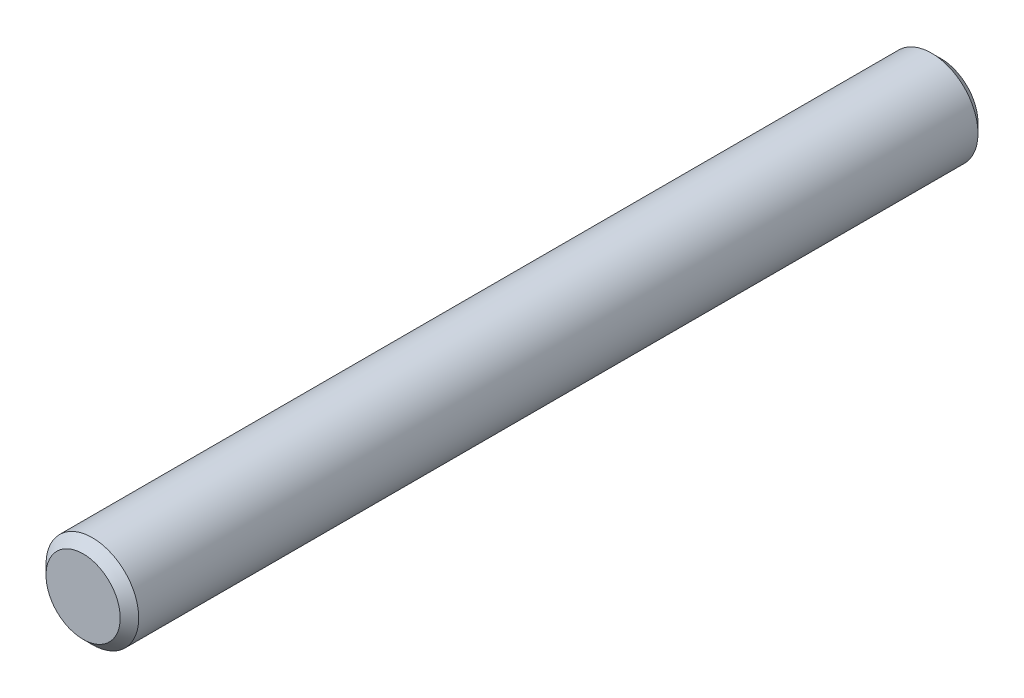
ISO-10303-21;
HEADER;
FILE_DESCRIPTION(('STEP AP214'),'2;1');
FILE_NAME('part.step','',(''),(''),'','','');
FILE_SCHEMA(('AUTOMOTIVE_DESIGN { 1 0 10303 214 1 1 1 1 }'));
ENDSEC;
DATA;
#1=APPLICATION_CONTEXT('core data for automotive mechanical design processes');
#2=APPLICATION_PROTOCOL_DEFINITION('international standard','automotive_design',2000,#1);
#3=PRODUCT_CONTEXT('',#1,'mechanical');
#4=PRODUCT('Part','Part','',(#3));
#5=PRODUCT_RELATED_PRODUCT_CATEGORY('part','',(#4));
#6=PRODUCT_DEFINITION_FORMATION('','',#4);
#7=PRODUCT_DEFINITION_CONTEXT('part definition',#1,'design');
#8=PRODUCT_DEFINITION('design','',#6,#7);
#9=PRODUCT_DEFINITION_SHAPE('','',#8);
#10=(LENGTH_UNIT() NAMED_UNIT(*) SI_UNIT(.MILLI.,.METRE.));
#11=(NAMED_UNIT(*) PLANE_ANGLE_UNIT() SI_UNIT($,.RADIAN.));
#12=(NAMED_UNIT(*) SI_UNIT($,.STERADIAN.) SOLID_ANGLE_UNIT());
#13=UNCERTAINTY_MEASURE_WITH_UNIT(LENGTH_MEASURE(1.E-05),#10,'distance_accuracy_value','');
#14=(GEOMETRIC_REPRESENTATION_CONTEXT(3) GLOBAL_UNCERTAINTY_ASSIGNED_CONTEXT((#13)) GLOBAL_UNIT_ASSIGNED_CONTEXT((#10,
#11,#12)) REPRESENTATION_CONTEXT('',''));
#15=CARTESIAN_POINT('',(0.,0.,0.));
#16=DIRECTION('',(0.,0.,1.));
#17=DIRECTION('',(1.,0.,0.));
#18=AXIS2_PLACEMENT_3D('',#15,#16,#17);
#19=CARTESIAN_POINT('',(0.,0.,92.5));
#20=DIRECTION('',(0.,0.,-1.));
#21=DIRECTION('',(-1.,0.,0.));
#22=AXIS2_PLACEMENT_3D('',#19,#20,#21);
#23=CYLINDRICAL_SURFACE('',#22,10.);
#24=CARTESIAN_POINT('',(0.,0.,-90.5000000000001));
#25=DIRECTION('',(0.,0.,1.));
#26=DIRECTION('',(1.,0.,0.));
#27=AXIS2_PLACEMENT_3D('',#24,#25,#26);
#28=CIRCLE('',#27,10.);
#29=CARTESIAN_POINT('',(10.,0.,-90.5000000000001));
#30=VERTEX_POINT('',#29);
#31=EDGE_CURVE('E40',#30,#30,#28,.T.);
#32=ORIENTED_EDGE('',*,*,#31,.T.);
#33=EDGE_LOOP('',(#32));
#34=FACE_BOUND('',#33,.T.);
#35=CARTESIAN_POINT('',(0.,0.,90.4999999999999));
#36=DIRECTION('',(0.,0.,1.));
#37=DIRECTION('',(1.,0.,0.));
#38=AXIS2_PLACEMENT_3D('',#35,#36,#37);
#39=CIRCLE('',#38,10.);
#40=CARTESIAN_POINT('',(10.,0.,90.4999999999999));
#41=VERTEX_POINT('',#40);
#42=EDGE_CURVE('E44',#41,#41,#39,.F.);
#43=ORIENTED_EDGE('',*,*,#42,.T.);
#44=EDGE_LOOP('',(#43));
#45=FACE_BOUND('',#44,.T.);
#46=ADVANCED_FACE('F29',(#34,#45),#23,.T.);
#47=CARTESIAN_POINT('',(0.,0.,92.5));
#48=DIRECTION('',(0.,0.,1.));
#49=DIRECTION('',(1.,0.,0.));
#50=AXIS2_PLACEMENT_3D('',#47,#48,#49);
#51=PLANE('',#50);
#52=CARTESIAN_POINT('',(0.,0.,92.5));
#53=DIRECTION('',(0.,0.,1.));
#54=DIRECTION('',(1.,0.,0.));
#55=AXIS2_PLACEMENT_3D('',#52,#53,#54);
#56=CIRCLE('',#55,7.99999999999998);
#57=CARTESIAN_POINT('',(7.99999999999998,0.,92.5));
#58=VERTEX_POINT('',#57);
#59=EDGE_CURVE('E10',#58,#58,#56,.T.);
#60=ORIENTED_EDGE('',*,*,#59,.T.);
#61=EDGE_LOOP('',(#60));
#62=FACE_BOUND('',#61,.T.);
#63=ADVANCED_FACE('F60',(#62),#51,.T.);
#64=CARTESIAN_POINT('',(0.,0.,-92.5));
#65=DIRECTION('',(0.,0.,1.));
#66=DIRECTION('',(1.,0.,0.));
#67=AXIS2_PLACEMENT_3D('',#64,#65,#66);
#68=PLANE('',#67);
#69=CARTESIAN_POINT('',(0.,0.,-92.5));
#70=DIRECTION('',(0.,0.,1.));
#71=DIRECTION('',(1.,0.,0.));
#72=AXIS2_PLACEMENT_3D('',#69,#70,#71);
#73=CIRCLE('',#72,8.00000000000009);
#74=CARTESIAN_POINT('',(8.00000000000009,0.,-92.5));
#75=VERTEX_POINT('',#74);
#76=EDGE_CURVE('E36',#75,#75,#73,.F.);
#77=ORIENTED_EDGE('',*,*,#76,.T.);
#78=EDGE_LOOP('',(#77));
#79=FACE_BOUND('',#78,.T.);
#80=ADVANCED_FACE('F57',(#79),#68,.F.);
#81=CARTESIAN_POINT('',(0.,0.,-90.5000000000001));
#82=DIRECTION('',(0.,0.,1.));
#83=DIRECTION('',(1.,0.,0.));
#84=AXIS2_PLACEMENT_3D('',#81,#82,#83);
#85=CONICAL_SURFACE('',#84,10.,0.785398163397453);
#86=ORIENTED_EDGE('',*,*,#76,.F.);
#87=EDGE_LOOP('',(#86));
#88=FACE_BOUND('',#87,.T.);
#89=ORIENTED_EDGE('',*,*,#31,.F.);
#90=EDGE_LOOP('',(#89));
#91=FACE_BOUND('',#90,.T.);
#92=ADVANCED_FACE('F53',(#88,#91),#85,.T.);
#93=CARTESIAN_POINT('',(0.,0.,92.5));
#94=DIRECTION('',(0.,0.,-1.));
#95=DIRECTION('',(-1.,0.,0.));
#96=AXIS2_PLACEMENT_3D('',#93,#94,#95);
#97=CONICAL_SURFACE('',#96,7.99999999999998,0.785398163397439);
#98=ORIENTED_EDGE('',*,*,#42,.F.);
#99=EDGE_LOOP('',(#98));
#100=FACE_BOUND('',#99,.T.);
#101=ORIENTED_EDGE('',*,*,#59,.F.);
#102=EDGE_LOOP('',(#101));
#103=FACE_BOUND('',#102,.T.);
#104=ADVANCED_FACE('F31',(#100,#103),#97,.T.);
#105=CLOSED_SHELL('',(#46,#63,#80,#92,#104));
#106=MANIFOLD_SOLID_BREP('B2',#105);
#107=ADVANCED_BREP_SHAPE_REPRESENTATION('',(#18,#106),#14);
#108=SHAPE_DEFINITION_REPRESENTATION(#9,#107);
ENDSEC;
END-ISO-10303-21;
